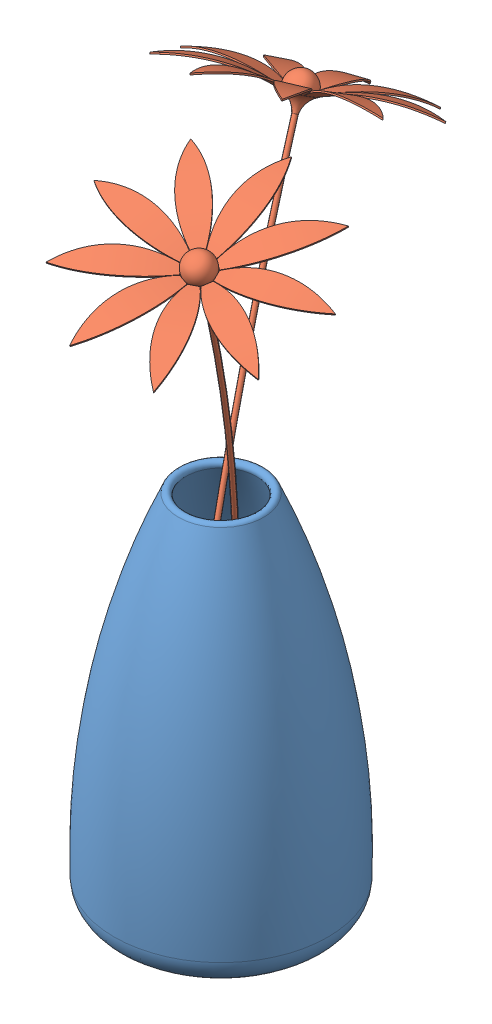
SolidWorks assembly Assem1.sldasm, configuration Default (file format 5000). Lengths in mm.
Overall size (140.68 253.64 192.46).
3 component instances, 2 part files, 0 mates.
Components (placement in the parent):
- gol-1: gol.SLDPRT [Default] at (-71.8575 -116.8923 44.8195) size (78.19 131.54 78.19)
- f3-1: f3.SLDPRT [Default] at (-48.8404 110.7983 75.6469) x (-0.955241 0.223805 -0.193458) z (0.25562 0.295277 -0.920581) size (78.78 223.03 77.59)
- f3-2: f3.SLDPRT [Default] at (-94.0047 103.826 -5.9107) x (0.963047 0.046524 -0.265286) z (0.20622 0.506199 0.837398) size (78.78 223.03 77.59)
